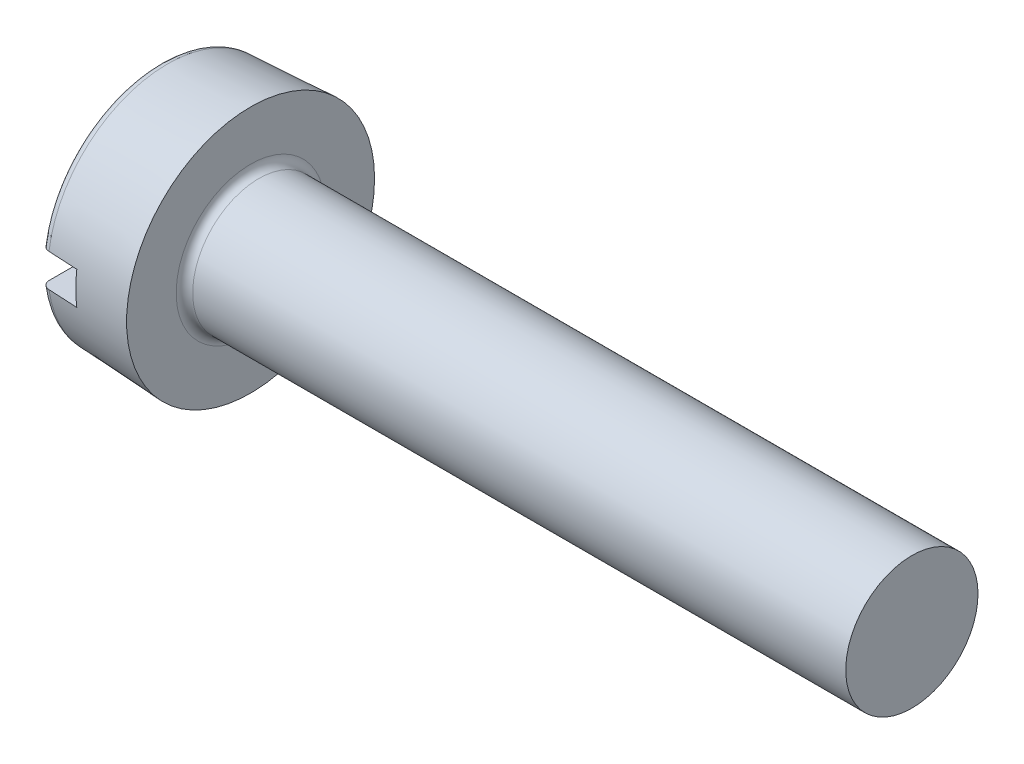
ISO-10303-21;
HEADER;
FILE_DESCRIPTION(('STEP AP214'),'2;1');
FILE_NAME('part.step','',(''),(''),'','','');
FILE_SCHEMA(('AUTOMOTIVE_DESIGN { 1 0 10303 214 1 1 1 1 }'));
ENDSEC;
DATA;
#1=APPLICATION_CONTEXT('core data for automotive mechanical design processes');
#2=APPLICATION_PROTOCOL_DEFINITION('international standard','automotive_design',2000,#1);
#3=PRODUCT_CONTEXT('',#1,'mechanical');
#4=PRODUCT('Part','Part','',(#3));
#5=PRODUCT_RELATED_PRODUCT_CATEGORY('part','',(#4));
#6=PRODUCT_DEFINITION_FORMATION('','',#4);
#7=PRODUCT_DEFINITION_CONTEXT('part definition',#1,'design');
#8=PRODUCT_DEFINITION('design','',#6,#7);
#9=PRODUCT_DEFINITION_SHAPE('','',#8);
#10=(LENGTH_UNIT() NAMED_UNIT(*) SI_UNIT(.MILLI.,.METRE.));
#11=(NAMED_UNIT(*) PLANE_ANGLE_UNIT() SI_UNIT($,.RADIAN.));
#12=(NAMED_UNIT(*) SI_UNIT($,.STERADIAN.) SOLID_ANGLE_UNIT());
#13=UNCERTAINTY_MEASURE_WITH_UNIT(LENGTH_MEASURE(1.E-05),#10,'distance_accuracy_value','');
#14=(GEOMETRIC_REPRESENTATION_CONTEXT(3) GLOBAL_UNCERTAINTY_ASSIGNED_CONTEXT((#13)) GLOBAL_UNIT_ASSIGNED_CONTEXT((#10,
#11,#12)) REPRESENTATION_CONTEXT('',''));
#15=CARTESIAN_POINT('',(0.,0.,0.));
#16=DIRECTION('',(0.,0.,1.));
#17=DIRECTION('',(1.,0.,0.));
#18=AXIS2_PLACEMENT_3D('',#15,#16,#17);
#19=CARTESIAN_POINT('',(0.,0.,0.));
#20=DIRECTION('',(1.,0.,0.));
#21=DIRECTION('',(0.,0.,-1.));
#22=AXIS2_PLACEMENT_3D('',#19,#20,#21);
#23=PLANE('',#22);
#24=DIRECTION('',(0.,0.,-1.));
#25=VECTOR('',#24,1.);
#26=CARTESIAN_POINT('',(0.,-0.2,0.));
#27=LINE('',#26,#25);
#28=CARTESIAN_POINT('',(0.,-0.2,1.33252952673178));
#29=VERTEX_POINT('',#28);
#30=CARTESIAN_POINT('',(0.,-0.2,-1.33252952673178));
#31=VERTEX_POINT('',#30);
#32=EDGE_CURVE('E110',#29,#31,#27,.T.);
#33=ORIENTED_EDGE('',*,*,#32,.T.);
#34=CARTESIAN_POINT('',(0.,0.,0.));
#35=DIRECTION('',(1.,0.,0.));
#36=DIRECTION('',(0.,0.,-1.));
#37=AXIS2_PLACEMENT_3D('',#34,#35,#36);
#38=CIRCLE('',#37,1.34745498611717);
#39=EDGE_CURVE('E192',#31,#29,#38,.F.);
#40=ORIENTED_EDGE('',*,*,#39,.T.);
#41=EDGE_LOOP('',(#33,#40));
#42=FACE_BOUND('',#41,.T.);
#43=ADVANCED_FACE('F30',(#42),#23,.F.);
#44=CARTESIAN_POINT('',(1.1,0.,0.));
#45=DIRECTION('',(1.,0.,0.));
#46=DIRECTION('',(0.,0.,-1.));
#47=AXIS2_PLACEMENT_3D('',#44,#45,#46);
#48=PLANE('',#47);
#49=CARTESIAN_POINT('',(1.1,0.,0.));
#50=DIRECTION('',(1.,0.,0.));
#51=DIRECTION('',(0.,0.,-1.));
#52=AXIS2_PLACEMENT_3D('',#49,#50,#51);
#53=CIRCLE('',#52,0.9);
#54=CARTESIAN_POINT('',(1.1,0.,-0.9));
#55=VERTEX_POINT('',#54);
#56=EDGE_CURVE('E120',#55,#55,#53,.F.);
#57=ORIENTED_EDGE('',*,*,#56,.T.);
#58=EDGE_LOOP('',(#57));
#59=FACE_BOUND('',#58,.T.);
#60=CARTESIAN_POINT('',(1.1,0.,0.));
#61=DIRECTION('',(1.,0.,0.));
#62=DIRECTION('',(0.,0.,-1.));
#63=AXIS2_PLACEMENT_3D('',#60,#61,#62);
#64=CIRCLE('',#63,1.5);
#65=CARTESIAN_POINT('',(1.1,0.,-1.5));
#66=VERTEX_POINT('',#65);
#67=EDGE_CURVE('E218',#66,#66,#64,.T.);
#68=ORIENTED_EDGE('',*,*,#67,.T.);
#69=EDGE_LOOP('',(#68));
#70=FACE_BOUND('',#69,.T.);
#71=ADVANCED_FACE('F169',(#59,#70),#48,.T.);
#72=CARTESIAN_POINT('',(1.1,0.,0.));
#73=DIRECTION('',(1.,0.,0.));
#74=DIRECTION('',(0.,0.,-1.));
#75=AXIS2_PLACEMENT_3D('',#72,#73,#74);
#76=CONICAL_SURFACE('',#75,1.5,0.05235987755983);
#77=CARTESIAN_POINT('',(-2.54984858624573,-0.2,1.29334714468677));
#78=CARTESIAN_POINT('',(-1.63047935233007,-0.2,1.34209126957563));
#79=CARTESIAN_POINT('',(-0.711107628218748,-0.2,1.39078833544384));
#80=CARTESIAN_POINT('',(1.12764079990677,-0.2,1.48808834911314));
#81=CARTESIAN_POINT('',(2.04701750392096,-0.2,1.53669129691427));
#82=CARTESIAN_POINT('',(2.9663966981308,-0.2,1.5852471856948));
#83=B_SPLINE_CURVE_WITH_KNOTS('',3,(#77,#78,#79,#80,#81,#82),.UNSPECIFIED.,.F.,.F.,(4,2,4),(0.,
2.76198152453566,5.52396304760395),.UNSPECIFIED.);
#84=CARTESIAN_POINT('',(0.0947664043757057,-0.2,1.43343266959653));
#85=VERTEX_POINT('',#84);
#86=CARTESIAN_POINT('',(0.45,-0.2,1.45222768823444));
#87=VERTEX_POINT('',#86);
#88=EDGE_CURVE('E91',#85,#87,#83,.T.);
#89=ORIENTED_EDGE('',*,*,#88,.F.);
#90=CARTESIAN_POINT('',(0.0947664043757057,0.,0.));
#91=DIRECTION('',(1.,0.,0.));
#92=DIRECTION('',(0.,0.,-1.));
#93=AXIS2_PLACEMENT_3D('',#90,#91,#92);
#94=CIRCLE('',#93,1.44731793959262);
#95=CARTESIAN_POINT('',(0.0947664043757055,-0.2,-1.43343266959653));
#96=VERTEX_POINT('',#95);
#97=EDGE_CURVE('E125',#85,#96,#94,.T.);
#98=ORIENTED_EDGE('',*,*,#97,.T.);
#99=CARTESIAN_POINT('',(2.9663966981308,-0.2,-1.5852471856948));
#100=CARTESIAN_POINT('',(2.04701750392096,-0.2,-1.53669129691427));
#101=CARTESIAN_POINT('',(1.12764079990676,-0.2,-1.48808834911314));
#102=CARTESIAN_POINT('',(-0.711107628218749,-0.2,-1.39078833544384));
#103=CARTESIAN_POINT('',(-1.63047935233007,-0.2,-1.34209126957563));
#104=CARTESIAN_POINT('',(-2.54984858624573,-0.2,-1.29334714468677));
#105=B_SPLINE_CURVE_WITH_KNOTS('',3,(#99,#100,#101,#102,#103,#104),.UNSPECIFIED.,.F.,.F.,(4,2,
4),(0.,2.76198152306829,5.52396304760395),.UNSPECIFIED.);
#106=CARTESIAN_POINT('',(0.45,-0.2,-1.45222768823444));
#107=VERTEX_POINT('',#106);
#108=EDGE_CURVE('E109',#107,#96,#105,.T.);
#109=ORIENTED_EDGE('',*,*,#108,.F.);
#110=CARTESIAN_POINT('',(0.45,0.,0.));
#111=DIRECTION('',(1.,0.,0.));
#112=DIRECTION('',(0.,0.,-1.));
#113=AXIS2_PLACEMENT_3D('',#110,#111,#112);
#114=CIRCLE('',#113,1.46593494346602);
#115=CARTESIAN_POINT('',(0.45,0.2,-1.45222768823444));
#116=VERTEX_POINT('',#115);
#117=EDGE_CURVE('E97',#116,#107,#114,.F.);
#118=ORIENTED_EDGE('',*,*,#117,.F.);
#119=CARTESIAN_POINT('',(-2.54984858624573,0.199999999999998,-1.29334714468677));
#120=CARTESIAN_POINT('',(-1.63047935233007,0.199999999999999,-1.34209126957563));
#121=CARTESIAN_POINT('',(-0.711107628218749,0.199999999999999,-1.39078833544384));
#122=CARTESIAN_POINT('',(1.12764079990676,0.200000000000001,-1.48808834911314));
#123=CARTESIAN_POINT('',(2.04701750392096,0.200000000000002,-1.53669129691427));
#124=CARTESIAN_POINT('',(2.9663966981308,0.200000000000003,-1.5852471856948));
#125=B_SPLINE_CURVE_WITH_KNOTS('',3,(#119,#120,#121,#122,#123,#124),.UNSPECIFIED.,.F.,.F.,(4,2,
4),(0.,2.76198152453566,5.52396304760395),.UNSPECIFIED.);
#126=CARTESIAN_POINT('',(0.0947664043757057,0.2,-1.43343266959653));
#127=VERTEX_POINT('',#126);
#128=EDGE_CURVE('E80',#127,#116,#125,.T.);
#129=ORIENTED_EDGE('',*,*,#128,.F.);
#130=CARTESIAN_POINT('',(0.0947664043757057,0.,0.));
#131=DIRECTION('',(1.,0.,0.));
#132=DIRECTION('',(0.,0.,-1.));
#133=AXIS2_PLACEMENT_3D('',#130,#131,#132);
#134=CIRCLE('',#133,1.44731793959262);
#135=CARTESIAN_POINT('',(0.0947664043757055,0.2,1.43343266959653));
#136=VERTEX_POINT('',#135);
#137=EDGE_CURVE('E123',#127,#136,#134,.T.);
#138=ORIENTED_EDGE('',*,*,#137,.T.);
#139=CARTESIAN_POINT('',(2.9663966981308,0.200000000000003,1.5852471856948));
#140=CARTESIAN_POINT('',(2.04701750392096,0.200000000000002,1.53669129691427));
#141=CARTESIAN_POINT('',(1.12764079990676,0.200000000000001,1.48808834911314));
#142=CARTESIAN_POINT('',(-0.711107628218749,0.199999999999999,1.39078833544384));
#143=CARTESIAN_POINT('',(-1.63047935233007,0.199999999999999,1.34209126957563));
#144=CARTESIAN_POINT('',(-2.54984858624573,0.199999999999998,1.29334714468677));
#145=B_SPLINE_CURVE_WITH_KNOTS('',3,(#139,#140,#141,#142,#143,#144),.UNSPECIFIED.,.F.,.F.,(4,2,
4),(0.,2.76198152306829,5.52396304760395),.UNSPECIFIED.);
#146=CARTESIAN_POINT('',(0.45,0.2,1.45222768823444));
#147=VERTEX_POINT('',#146);
#148=EDGE_CURVE('E92',#147,#136,#145,.T.);
#149=ORIENTED_EDGE('',*,*,#148,.F.);
#150=EDGE_CURVE('E100',#87,#147,#114,.F.);
#151=ORIENTED_EDGE('',*,*,#150,.F.);
#152=EDGE_LOOP('',(#89,#98,#109,#118,#129,#138,#149,#151));
#153=FACE_BOUND('',#152,.T.);
#154=ORIENTED_EDGE('',*,*,#67,.F.);
#155=EDGE_LOOP('',(#154));
#156=FACE_BOUND('',#155,.T.);
#157=ADVANCED_FACE('F105',(#153,#156),#76,.T.);
#158=DIRECTION('',(0.,0.,1.));
#159=VECTOR('',#158,1.);
#160=CARTESIAN_POINT('',(0.,0.2,0.));
#161=LINE('',#160,#159);
#162=CARTESIAN_POINT('',(0.,0.2,-1.33252952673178));
#163=VERTEX_POINT('',#162);
#164=CARTESIAN_POINT('',(0.,0.2,1.33252952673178));
#165=VERTEX_POINT('',#164);
#166=EDGE_CURVE('E114',#163,#165,#161,.T.);
#167=ORIENTED_EDGE('',*,*,#166,.T.);
#168=CARTESIAN_POINT('',(0.,0.,0.));
#169=DIRECTION('',(1.,0.,0.));
#170=DIRECTION('',(0.,0.,-1.));
#171=AXIS2_PLACEMENT_3D('',#168,#169,#170);
#172=CIRCLE('',#171,1.34745498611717);
#173=EDGE_CURVE('E11',#165,#163,#172,.F.);
#174=ORIENTED_EDGE('',*,*,#173,.T.);
#175=EDGE_LOOP('',(#167,#174));
#176=FACE_BOUND('',#175,.T.);
#177=ADVANCED_FACE('F168',(#176),#23,.F.);
#178=CARTESIAN_POINT('',(9.09999999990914,0.,0.));
#179=DIRECTION('',(-1.,0.,0.));
#180=DIRECTION('',(0.,0.,1.));
#181=AXIS2_PLACEMENT_3D('',#178,#179,#180);
#182=CYLINDRICAL_SURFACE('',#181,0.8);
#183=CARTESIAN_POINT('',(1.2,0.,0.));
#184=DIRECTION('',(1.,0.,0.));
#185=DIRECTION('',(0.,0.,-1.));
#186=AXIS2_PLACEMENT_3D('',#183,#184,#185);
#187=CIRCLE('',#186,0.8);
#188=CARTESIAN_POINT('',(1.2,0.,-0.8));
#189=VERTEX_POINT('',#188);
#190=EDGE_CURVE('E112',#189,#189,#187,.T.);
#191=ORIENTED_EDGE('',*,*,#190,.T.);
#192=EDGE_LOOP('',(#191));
#193=FACE_BOUND('',#192,.T.);
#194=CARTESIAN_POINT('',(9.09999999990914,0.,0.));
#195=DIRECTION('',(1.,0.,0.));
#196=DIRECTION('',(0.,0.,-1.));
#197=AXIS2_PLACEMENT_3D('',#194,#195,#196);
#198=CIRCLE('',#197,0.8);
#199=CARTESIAN_POINT('',(9.09999999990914,0.,-0.8));
#200=VERTEX_POINT('',#199);
#201=EDGE_CURVE('E163',#200,#200,#198,.T.);
#202=ORIENTED_EDGE('',*,*,#201,.F.);
#203=EDGE_LOOP('',(#202));
#204=FACE_BOUND('',#203,.T.);
#205=ADVANCED_FACE('F213',(#193,#204),#182,.T.);
#206=CARTESIAN_POINT('',(9.09999999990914,0.,0.));
#207=DIRECTION('',(1.,0.,0.));
#208=DIRECTION('',(0.,0.,-1.));
#209=AXIS2_PLACEMENT_3D('',#206,#207,#208);
#210=PLANE('',#209);
#211=ORIENTED_EDGE('',*,*,#201,.T.);
#212=EDGE_LOOP('',(#211));
#213=FACE_BOUND('',#212,.T.);
#214=ADVANCED_FACE('F146',(#213),#210,.T.);
#215=CARTESIAN_POINT('',(0.,-0.2,-1.5));
#216=DIRECTION('',(0.,-1.,0.));
#217=DIRECTION('',(0.,0.,-1.));
#218=AXIS2_PLACEMENT_3D('',#215,#216,#217);
#219=PLANE('',#218);
#220=ORIENTED_EDGE('',*,*,#108,.T.);
#221=CARTESIAN_POINT('',(0.0947664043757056,-0.2,-1.43343266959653));
#222=CARTESIAN_POINT('',(0.0891837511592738,-0.2,-1.43314224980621));
#223=CARTESIAN_POINT('',(0.08362842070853,-0.2,-1.43236968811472));
#224=CARTESIAN_POINT('',(0.0727310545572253,-0.2,-1.42990634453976));
#225=CARTESIAN_POINT('',(0.067388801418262,-0.2,-1.42821652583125));
#226=CARTESIAN_POINT('',(0.0570619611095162,-0.2,-1.42396313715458));
#227=CARTESIAN_POINT('',(0.0520775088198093,-0.2,-1.42139923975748));
#228=CARTESIAN_POINT('',(0.0426078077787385,-0.2,-1.41547540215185));
#229=CARTESIAN_POINT('',(0.0381224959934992,-0.2,-1.41211556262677));
#230=CARTESIAN_POINT('',(0.0297543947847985,-0.2,-1.40467997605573));
#231=CARTESIAN_POINT('',(0.0258744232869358,-0.2,-1.40060105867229));
#232=CARTESIAN_POINT('',(0.0188455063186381,-0.2,-1.3918537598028));
#233=CARTESIAN_POINT('',(0.0156967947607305,-0.2,-1.38718519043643));
#234=CARTESIAN_POINT('',(0.0101883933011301,-0.2,-1.37734415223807));
#235=CARTESIAN_POINT('',(0.00783674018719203,-0.2,-1.37216719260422));
#236=CARTESIAN_POINT('',(0.0040288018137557,-0.2,-1.36149629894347));
#237=CARTESIAN_POINT('',(0.00257176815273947,-0.2,-1.35600263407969));
#238=CARTESIAN_POINT('',(0.00105375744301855,-0.2,-1.34747504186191));
#239=CARTESIAN_POINT('',(0.000658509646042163,-0.2,-1.34449689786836));
#240=CARTESIAN_POINT('',(0.000131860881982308,-0.2,-1.33852277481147));
#241=CARTESIAN_POINT('',(-1.42210552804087E-08,-0.2,-1.33552683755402));
#242=CARTESIAN_POINT('',(0.,-0.2,-1.33252952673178));
#243=B_SPLINE_CURVE_WITH_KNOTS('',3,(#221,#222,#223,#224,#225,#226,#227,#228,#229,#230,#231,
#232,#233,#234,#235,#236,#237,#238,#239,#240,#241,#242),.UNSPECIFIED.,.F.,.F.,(4,2,2,2,2,2,2,2,
2,2,4),(0.,0.0167475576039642,0.0334775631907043,0.0502138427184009,0.0669480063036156,
0.0837578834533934,0.100573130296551,0.11755320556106,0.134519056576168,0.143521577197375,
0.152507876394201),.UNSPECIFIED.);
#244=EDGE_CURVE('E133',#96,#31,#243,.T.);
#245=ORIENTED_EDGE('',*,*,#244,.T.);
#246=ORIENTED_EDGE('',*,*,#32,.F.);
#247=CARTESIAN_POINT('',(0.,-0.2,1.33252952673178));
#248=CARTESIAN_POINT('',(-4.60430735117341E-06,-0.2,1.33825895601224));
#249=CARTESIAN_POINT('',(0.000481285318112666,-0.2,1.34398744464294));
#250=CARTESIAN_POINT('',(0.00240152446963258,-0.2,1.35528090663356));
#251=CARTESIAN_POINT('',(0.00383548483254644,-0.2,1.36084594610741));
#252=CARTESIAN_POINT('',(0.00762056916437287,-0.2,1.37165921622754));
#253=CARTESIAN_POINT('',(0.0099722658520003,-0.2,1.3769072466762));
#254=CARTESIAN_POINT('',(0.0155272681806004,-0.2,1.38692944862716));
#255=CARTESIAN_POINT('',(0.0187303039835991,-0.2,1.39170376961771));
#256=CARTESIAN_POINT('',(0.0258799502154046,-0.2,1.40061444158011));
#257=CARTESIAN_POINT('',(0.0298222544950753,-0.2,1.40475424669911));
#258=CARTESIAN_POINT('',(0.0383536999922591,-0.2,1.41230656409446));
#259=CARTESIAN_POINT('',(0.0429430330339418,-0.2,1.4157188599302));
#260=CARTESIAN_POINT('',(0.0525889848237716,-0.2,1.42168248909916));
#261=CARTESIAN_POINT('',(0.0576407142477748,-0.2,1.42424174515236));
#262=CARTESIAN_POINT('',(0.0681022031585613,-0.2,1.42846494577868));
#263=CARTESIAN_POINT('',(0.0735115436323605,-0.2,1.43012991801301));
#264=CARTESIAN_POINT('',(0.0816111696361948,-0.2,1.43188552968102));
#265=CARTESIAN_POINT('',(0.084226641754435,-0.2,1.43234309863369));
#266=CARTESIAN_POINT('',(0.0894812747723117,-0.2,1.43304645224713));
#267=CARTESIAN_POINT('',(0.0921203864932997,-0.2,1.43329260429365));
#268=CARTESIAN_POINT('',(0.0947664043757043,-0.2,1.43343266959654));
#269=B_SPLINE_CURVE_WITH_KNOTS('',3,(#247,#248,#249,#250,#251,#252,#253,#254,#255,#256,#257,
#258,#259,#260,#261,#262,#263,#264,#265,#266,#267,#268),.UNSPECIFIED.,.F.,.F.,(4,2,2,2,2,2,2,2,
2,2,4),(0.,0.0171664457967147,0.0343258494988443,0.0514959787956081,0.0686606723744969,
0.0857283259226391,0.102801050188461,0.11971047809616,0.136600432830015,0.144558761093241,
0.152503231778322),.UNSPECIFIED.);
#270=EDGE_CURVE('E127',#29,#85,#269,.T.);
#271=ORIENTED_EDGE('',*,*,#270,.T.);
#272=ORIENTED_EDGE('',*,*,#88,.T.);
#273=DIRECTION('',(0.,0.,1.));
#274=VECTOR('',#273,1.);
#275=CARTESIAN_POINT('',(0.45,-0.2,-1.5));
#276=LINE('',#275,#274);
#277=EDGE_CURVE('E101',#107,#87,#276,.T.);
#278=ORIENTED_EDGE('',*,*,#277,.F.);
#279=EDGE_LOOP('',(#220,#245,#246,#271,#272,#278));
#280=FACE_BOUND('',#279,.T.);
#281=ADVANCED_FACE('F141',(#280),#219,.F.);
#282=CARTESIAN_POINT('',(0.,0.2,-1.5));
#283=DIRECTION('',(0.,1.,0.));
#284=DIRECTION('',(-1.,0.,0.));
#285=AXIS2_PLACEMENT_3D('',#282,#283,#284);
#286=PLANE('',#285);
#287=ORIENTED_EDGE('',*,*,#148,.T.);
#288=CARTESIAN_POINT('',(0.0947664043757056,0.2,1.43343266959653));
#289=CARTESIAN_POINT('',(0.0891837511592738,0.2,1.43314224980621));
#290=CARTESIAN_POINT('',(0.08362842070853,0.2,1.43236968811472));
#291=CARTESIAN_POINT('',(0.0727310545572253,0.2,1.42990634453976));
#292=CARTESIAN_POINT('',(0.067388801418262,0.2,1.42821652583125));
#293=CARTESIAN_POINT('',(0.0570619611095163,0.2,1.42396313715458));
#294=CARTESIAN_POINT('',(0.0520775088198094,0.2,1.42139923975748));
#295=CARTESIAN_POINT('',(0.0426078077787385,0.2,1.41547540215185));
#296=CARTESIAN_POINT('',(0.0381224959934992,0.2,1.41211556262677));
#297=CARTESIAN_POINT('',(0.0297543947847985,0.2,1.40467997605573));
#298=CARTESIAN_POINT('',(0.0258744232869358,0.2,1.40060105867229));
#299=CARTESIAN_POINT('',(0.0188455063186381,0.2,1.3918537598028));
#300=CARTESIAN_POINT('',(0.0156967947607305,0.2,1.38718519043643));
#301=CARTESIAN_POINT('',(0.0101883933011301,0.2,1.37734415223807));
#302=CARTESIAN_POINT('',(0.00783674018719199,0.2,1.37216719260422));
#303=CARTESIAN_POINT('',(0.00402880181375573,0.2,1.36149629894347));
#304=CARTESIAN_POINT('',(0.00257176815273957,0.2,1.35600263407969));
#305=CARTESIAN_POINT('',(0.00105375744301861,0.2,1.34747504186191));
#306=CARTESIAN_POINT('',(0.000658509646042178,0.2,1.34449689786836));
#307=CARTESIAN_POINT('',(0.000131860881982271,0.2,1.33852277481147));
#308=CARTESIAN_POINT('',(-1.42210553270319E-08,0.2,1.33552683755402));
#309=CARTESIAN_POINT('',(0.,0.2,1.33252952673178));
#310=B_SPLINE_CURVE_WITH_KNOTS('',3,(#288,#289,#290,#291,#292,#293,#294,#295,#296,#297,#298,
#299,#300,#301,#302,#303,#304,#305,#306,#307,#308,#309),.UNSPECIFIED.,.F.,.F.,(4,2,2,2,2,2,2,2,
2,2,4),(0.,0.0167475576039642,0.0334775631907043,0.0502138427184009,0.0669480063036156,
0.0837578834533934,0.100573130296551,0.11755320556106,0.134519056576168,0.143521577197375,
0.152507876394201),.UNSPECIFIED.);
#311=EDGE_CURVE('E39',#136,#165,#310,.T.);
#312=ORIENTED_EDGE('',*,*,#311,.T.);
#313=ORIENTED_EDGE('',*,*,#166,.F.);
#314=CARTESIAN_POINT('',(0.,0.2,-1.33252952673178));
#315=CARTESIAN_POINT('',(-4.60430735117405E-06,0.2,-1.33825895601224));
#316=CARTESIAN_POINT('',(0.000481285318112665,0.2,-1.34398744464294));
#317=CARTESIAN_POINT('',(0.00240152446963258,0.2,-1.35528090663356));
#318=CARTESIAN_POINT('',(0.00383548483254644,0.2,-1.36084594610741));
#319=CARTESIAN_POINT('',(0.00762056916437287,0.2,-1.37165921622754));
#320=CARTESIAN_POINT('',(0.00997226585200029,0.2,-1.3769072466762));
#321=CARTESIAN_POINT('',(0.0155272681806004,0.2,-1.38692944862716));
#322=CARTESIAN_POINT('',(0.0187303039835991,0.2,-1.39170376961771));
#323=CARTESIAN_POINT('',(0.0258799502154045,0.2,-1.40061444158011));
#324=CARTESIAN_POINT('',(0.0298222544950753,0.2,-1.40475424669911));
#325=CARTESIAN_POINT('',(0.0383536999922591,0.2,-1.41230656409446));
#326=CARTESIAN_POINT('',(0.0429430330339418,0.2,-1.4157188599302));
#327=CARTESIAN_POINT('',(0.0525889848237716,0.2,-1.42168248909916));
#328=CARTESIAN_POINT('',(0.0576407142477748,0.2,-1.42424174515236));
#329=CARTESIAN_POINT('',(0.0681022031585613,0.2,-1.42846494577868));
#330=CARTESIAN_POINT('',(0.0735115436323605,0.2,-1.43012991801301));
#331=CARTESIAN_POINT('',(0.0816111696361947,0.2,-1.43188552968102));
#332=CARTESIAN_POINT('',(0.084226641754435,0.2,-1.43234309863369));
#333=CARTESIAN_POINT('',(0.0894812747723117,0.2,-1.43304645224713));
#334=CARTESIAN_POINT('',(0.0921203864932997,0.2,-1.43329260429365));
#335=CARTESIAN_POINT('',(0.0947664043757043,0.2,-1.43343266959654));
#336=B_SPLINE_CURVE_WITH_KNOTS('',3,(#314,#315,#316,#317,#318,#319,#320,#321,#322,#323,#324,
#325,#326,#327,#328,#329,#330,#331,#332,#333,#334,#335),.UNSPECIFIED.,.F.,.F.,(4,2,2,2,2,2,2,2,
2,2,4),(0.,0.0171664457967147,0.0343258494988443,0.0514959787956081,0.0686606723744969,
0.0857283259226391,0.102801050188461,0.11971047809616,0.136600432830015,0.144558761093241,
0.152503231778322),.UNSPECIFIED.);
#337=EDGE_CURVE('E86',#163,#127,#336,.T.);
#338=ORIENTED_EDGE('',*,*,#337,.T.);
#339=ORIENTED_EDGE('',*,*,#128,.T.);
#340=DIRECTION('',(0.,0.,1.));
#341=VECTOR('',#340,1.);
#342=CARTESIAN_POINT('',(0.45,0.200000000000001,-1.5));
#343=LINE('',#342,#341);
#344=EDGE_CURVE('E83',#116,#147,#343,.T.);
#345=ORIENTED_EDGE('',*,*,#344,.T.);
#346=EDGE_LOOP('',(#287,#312,#313,#338,#339,#345));
#347=FACE_BOUND('',#346,.T.);
#348=ADVANCED_FACE('F82',(#347),#286,.F.);
#349=CARTESIAN_POINT('',(0.45,-0.2,-1.5));
#350=DIRECTION('',(1.,0.,0.));
#351=DIRECTION('',(0.,0.,-1.));
#352=AXIS2_PLACEMENT_3D('',#349,#350,#351);
#353=PLANE('',#352);
#354=ORIENTED_EDGE('',*,*,#150,.T.);
#355=ORIENTED_EDGE('',*,*,#344,.F.);
#356=ORIENTED_EDGE('',*,*,#117,.T.);
#357=ORIENTED_EDGE('',*,*,#277,.T.);
#358=EDGE_LOOP('',(#354,#355,#356,#357));
#359=FACE_BOUND('',#358,.T.);
#360=ADVANCED_FACE('F95',(#359),#353,.F.);
#361=CARTESIAN_POINT('',(1.2,0.,0.));
#362=DIRECTION('',(1.,0.,0.));
#363=DIRECTION('',(0.,0.,-1.));
#364=AXIS2_PLACEMENT_3D('',#361,#362,#363);
#365=TOROIDAL_SURFACE('',#364,0.9,0.1);
#366=ORIENTED_EDGE('',*,*,#56,.F.);
#367=EDGE_LOOP('',(#366));
#368=FACE_BOUND('',#367,.T.);
#369=ORIENTED_EDGE('',*,*,#190,.F.);
#370=EDGE_LOOP('',(#369));
#371=FACE_BOUND('',#370,.T.);
#372=ADVANCED_FACE('F171',(#368,#371),#365,.F.);
#373=CARTESIAN_POINT('',(0.1,0.,0.));
#374=DIRECTION('',(1.,0.,0.));
#375=DIRECTION('',(0.,0.,-1.));
#376=AXIS2_PLACEMENT_3D('',#373,#374,#375);
#377=TOROIDAL_SURFACE('',#376,1.34745498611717,0.1);
#378=ORIENTED_EDGE('',*,*,#270,.F.);
#379=ORIENTED_EDGE('',*,*,#39,.F.);
#380=ORIENTED_EDGE('',*,*,#244,.F.);
#381=ORIENTED_EDGE('',*,*,#97,.F.);
#382=EDGE_LOOP('',(#378,#379,#380,#381));
#383=FACE_BOUND('',#382,.T.);
#384=ADVANCED_FACE('F138',(#383),#377,.T.);
#385=CARTESIAN_POINT('',(0.1,0.,0.));
#386=DIRECTION('',(1.,0.,0.));
#387=DIRECTION('',(0.,0.,-1.));
#388=AXIS2_PLACEMENT_3D('',#385,#386,#387);
#389=TOROIDAL_SURFACE('',#388,1.34745498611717,0.1);
#390=ORIENTED_EDGE('',*,*,#337,.F.);
#391=ORIENTED_EDGE('',*,*,#173,.F.);
#392=ORIENTED_EDGE('',*,*,#311,.F.);
#393=ORIENTED_EDGE('',*,*,#137,.F.);
#394=EDGE_LOOP('',(#390,#391,#392,#393));
#395=FACE_BOUND('',#394,.T.);
#396=ADVANCED_FACE('F32',(#395),#389,.T.);
#397=CLOSED_SHELL('',(#43,#71,#157,#177,#205,#214,#281,#348,#360,#372,#384,#396));
#398=MANIFOLD_SOLID_BREP('B2',#397);
#399=ADVANCED_BREP_SHAPE_REPRESENTATION('',(#18,#398),#14);
#400=SHAPE_DEFINITION_REPRESENTATION(#9,#399);
ENDSEC;
END-ISO-10303-21;
